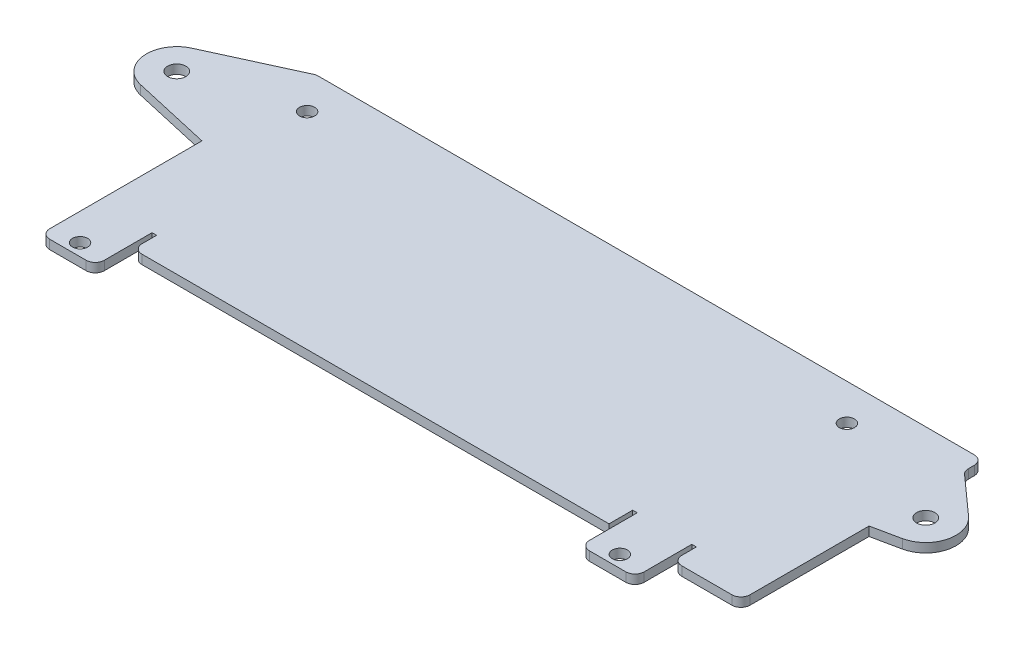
ISO-10303-21;
HEADER;
FILE_DESCRIPTION(('STEP AP214'),'2;1');
FILE_NAME('part.step','',(''),(''),'','','');
FILE_SCHEMA(('AUTOMOTIVE_DESIGN { 1 0 10303 214 1 1 1 1 }'));
ENDSEC;
DATA;
#1=APPLICATION_CONTEXT('core data for automotive mechanical design processes');
#2=APPLICATION_PROTOCOL_DEFINITION('international standard','automotive_design',2000,#1);
#3=PRODUCT_CONTEXT('',#1,'mechanical');
#4=PRODUCT('Part','Part','',(#3));
#5=PRODUCT_RELATED_PRODUCT_CATEGORY('part','',(#4));
#6=PRODUCT_DEFINITION_FORMATION('','',#4);
#7=PRODUCT_DEFINITION_CONTEXT('part definition',#1,'design');
#8=PRODUCT_DEFINITION('design','',#6,#7);
#9=PRODUCT_DEFINITION_SHAPE('','',#8);
#10=(LENGTH_UNIT() NAMED_UNIT(*) SI_UNIT(.MILLI.,.METRE.));
#11=(NAMED_UNIT(*) PLANE_ANGLE_UNIT() SI_UNIT($,.RADIAN.));
#12=(NAMED_UNIT(*) SI_UNIT($,.STERADIAN.) SOLID_ANGLE_UNIT());
#13=UNCERTAINTY_MEASURE_WITH_UNIT(LENGTH_MEASURE(1.E-05),#10,'distance_accuracy_value','');
#14=(GEOMETRIC_REPRESENTATION_CONTEXT(3) GLOBAL_UNCERTAINTY_ASSIGNED_CONTEXT((#13)) GLOBAL_UNIT_ASSIGNED_CONTEXT((#10,
#11,#12)) REPRESENTATION_CONTEXT('',''));
#15=CARTESIAN_POINT('',(0.,0.,0.));
#16=DIRECTION('',(0.,0.,1.));
#17=DIRECTION('',(1.,0.,0.));
#18=AXIS2_PLACEMENT_3D('',#15,#16,#17);
#19=CARTESIAN_POINT('',(0.,0.,0.));
#20=DIRECTION('',(0.,1.,0.));
#21=DIRECTION('',(0.,0.,1.));
#22=AXIS2_PLACEMENT_3D('',#19,#20,#21);
#23=PLANE('',#22);
#24=DIRECTION('',(0.,0.,-1.));
#25=VECTOR('',#24,1.);
#26=CARTESIAN_POINT('',(43.75,0.,8.46991118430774));
#27=LINE('',#26,#25);
#28=CARTESIAN_POINT('',(43.75,1.12757025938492E-13,27.4699111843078));
#29=VERTEX_POINT('',#28);
#30=CARTESIAN_POINT('',(43.75,0.,25.0699111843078));
#31=VERTEX_POINT('',#30);
#32=EDGE_CURVE('E610',#29,#31,#27,.T.);
#33=ORIENTED_EDGE('',*,*,#32,.F.);
#34=CARTESIAN_POINT('',(45.25,1.12757025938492E-13,27.4699111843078));
#35=DIRECTION('',(0.,-1.,0.));
#36=DIRECTION('',(0.,0.,-1.));
#37=AXIS2_PLACEMENT_3D('',#34,#35,#36);
#38=CIRCLE('',#37,1.5);
#39=CARTESIAN_POINT('',(45.25,1.23165366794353E-13,28.9699111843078));
#40=VERTEX_POINT('',#39);
#41=EDGE_CURVE('E700',#29,#40,#38,.F.);
#42=ORIENTED_EDGE('',*,*,#41,.T.);
#43=DIRECTION('',(1.,0.,0.));
#44=VECTOR('',#43,1.);
#45=CARTESIAN_POINT('',(0.,1.30104260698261E-13,28.9699111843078));
#46=LINE('',#45,#44);
#47=CARTESIAN_POINT('',(53.5,1.23165366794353E-13,28.9699111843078));
#48=VERTEX_POINT('',#47);
#49=EDGE_CURVE('E675',#40,#48,#46,.T.);
#50=ORIENTED_EDGE('',*,*,#49,.T.);
#51=CARTESIAN_POINT('',(53.5,1.12757025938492E-13,27.4699111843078));
#52=DIRECTION('',(0.,-1.,0.));
#53=DIRECTION('',(0.,0.,-1.));
#54=AXIS2_PLACEMENT_3D('',#51,#52,#53);
#55=CIRCLE('',#54,1.5);
#56=CARTESIAN_POINT('',(55.,1.11022302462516E-13,27.4699111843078));
#57=VERTEX_POINT('',#56);
#58=EDGE_CURVE('E697',#48,#57,#55,.F.);
#59=ORIENTED_EDGE('',*,*,#58,.T.);
#60=DIRECTION('',(0.,0.,-1.));
#61=VECTOR('',#60,1.);
#62=CARTESIAN_POINT('',(55.,0.,8.46991118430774));
#63=LINE('',#62,#61);
#64=CARTESIAN_POINT('',(55.,0.,7.85000000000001));
#65=VERTEX_POINT('',#64);
#66=EDGE_CURVE('E353',#57,#65,#63,.T.);
#67=ORIENTED_EDGE('',*,*,#66,.T.);
#68=DIRECTION('',(0.978394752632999,0.,-0.206745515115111));
#69=VECTOR('',#68,1.);
#70=CARTESIAN_POINT('',(55.,0.,7.85000000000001));
#71=LINE('',#70,#69);
#72=CARTESIAN_POINT('',(59.5337275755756,0.,6.89197376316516));
#73=VERTEX_POINT('',#72);
#74=EDGE_CURVE('E330',#65,#73,#71,.T.);
#75=ORIENTED_EDGE('',*,*,#74,.T.);
#76=CARTESIAN_POINT('',(58.5,0.,2.00000000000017));
#77=DIRECTION('',(0.,1.,0.));
#78=DIRECTION('',(0.,0.,-1.));
#79=AXIS2_PLACEMENT_3D('',#76,#77,#78);
#80=CIRCLE('',#79,5.);
#81=CARTESIAN_POINT('',(61.8367523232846,0.,-1.72371909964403));
#82=VERTEX_POINT('',#81);
#83=EDGE_CURVE('E341',#73,#82,#80,.T.);
#84=ORIENTED_EDGE('',*,*,#83,.T.);
#85=DIRECTION('',(-0.74474381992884,0.,-0.667350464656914));
#86=VECTOR('',#85,1.);
#87=CARTESIAN_POINT('',(55.,0.,-7.85000000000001));
#88=LINE('',#87,#86);
#89=CARTESIAN_POINT('',(55.4989743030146,0.,-7.40287882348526));
#90=VERTEX_POINT('',#89);
#91=EDGE_CURVE('E348',#82,#90,#88,.T.);
#92=ORIENTED_EDGE('',*,*,#91,.T.);
#93=CARTESIAN_POINT('',(56.5,0.,-8.51999455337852));
#94=DIRECTION('',(0.,1.,0.));
#95=DIRECTION('',(0.,0.,1.));
#96=AXIS2_PLACEMENT_3D('',#93,#94,#95);
#97=CIRCLE('',#96,1.5);
#98=CARTESIAN_POINT('',(55.,0.,-8.51999455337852));
#99=VERTEX_POINT('',#98);
#100=EDGE_CURVE('E791',#90,#99,#97,.F.);
#101=ORIENTED_EDGE('',*,*,#100,.T.);
#102=DIRECTION('',(0.,0.,-1.));
#103=VECTOR('',#102,1.);
#104=CARTESIAN_POINT('',(55.,0.,11.));
#105=LINE('',#104,#103);
#106=CARTESIAN_POINT('',(55.,0.,-9.50000000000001));
#107=VERTEX_POINT('',#106);
#108=EDGE_CURVE('E379',#99,#107,#105,.T.);
#109=ORIENTED_EDGE('',*,*,#108,.T.);
#110=CARTESIAN_POINT('',(53.5,0.,-9.50000000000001));
#111=DIRECTION('',(0.,1.,0.));
#112=DIRECTION('',(0.,0.,1.));
#113=AXIS2_PLACEMENT_3D('',#110,#111,#112);
#114=CIRCLE('',#113,1.5);
#115=CARTESIAN_POINT('',(53.5,0.,-11.));
#116=VERTEX_POINT('',#115);
#117=EDGE_CURVE('E376',#107,#116,#114,.T.);
#118=ORIENTED_EDGE('',*,*,#117,.T.);
#119=DIRECTION('',(-1.,0.,0.));
#120=VECTOR('',#119,1.);
#121=CARTESIAN_POINT('',(55.,0.,-11.));
#122=LINE('',#121,#120);
#123=CARTESIAN_POINT('',(-54.6726312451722,0.,-11.));
#124=VERTEX_POINT('',#123);
#125=EDGE_CURVE('E372',#116,#124,#122,.T.);
#126=ORIENTED_EDGE('',*,*,#125,.T.);
#127=CARTESIAN_POINT('',(-54.6726312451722,0.,-9.49999999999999));
#128=DIRECTION('',(0.,1.,0.));
#129=DIRECTION('',(0.,0.,1.));
#130=AXIS2_PLACEMENT_3D('',#127,#128,#129);
#131=CIRCLE('',#130,1.5);
#132=CARTESIAN_POINT('',(-55.2976006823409,0.,-10.8636030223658));
#133=VERTEX_POINT('',#132);
#134=EDGE_CURVE('E369',#124,#133,#131,.T.);
#135=ORIENTED_EDGE('',*,*,#134,.T.);
#136=DIRECTION('',(-0.909068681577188,0.,0.41664629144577));
#137=VECTOR('',#136,1.);
#138=CARTESIAN_POINT('',(-69.0832314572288,0.,-4.54534340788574));
#139=LINE('',#138,#137);
#140=CARTESIAN_POINT('',(-69.0832314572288,0.,-4.54534340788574));
#141=VERTEX_POINT('',#140);
#142=EDGE_CURVE('E366',#133,#141,#139,.T.);
#143=ORIENTED_EDGE('',*,*,#142,.T.);
#144=CARTESIAN_POINT('',(-67.,0.,1.93626364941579E-13));
#145=DIRECTION('',(0.,1.,0.));
#146=DIRECTION('',(0.,0.,1.));
#147=AXIS2_PLACEMENT_3D('',#144,#145,#146);
#148=CIRCLE('',#147,5.);
#149=CARTESIAN_POINT('',(-68.1064148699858,0.,4.87604820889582));
#150=VERTEX_POINT('',#149);
#151=EDGE_CURVE('E359',#141,#150,#148,.T.);
#152=ORIENTED_EDGE('',*,*,#151,.T.);
#153=DIRECTION('',(0.975209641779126,0.,0.221282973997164));
#154=VECTOR('',#153,1.);
#155=CARTESIAN_POINT('',(-55.,0.,7.85000000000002));
#156=LINE('',#155,#154);
#157=CARTESIAN_POINT('',(-55.,0.,7.85000000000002));
#158=VERTEX_POINT('',#157);
#159=EDGE_CURVE('E355',#150,#158,#156,.T.);
#160=ORIENTED_EDGE('',*,*,#159,.T.);
#161=DIRECTION('',(0.,0.,1.));
#162=VECTOR('',#161,1.);
#163=CARTESIAN_POINT('',(-55.,0.,8.46991118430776));
#164=LINE('',#163,#162);
#165=CARTESIAN_POINT('',(-55.,1.90819582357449E-13,32.9398223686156));
#166=VERTEX_POINT('',#165);
#167=EDGE_CURVE('E679',#158,#166,#164,.T.);
#168=ORIENTED_EDGE('',*,*,#167,.T.);
#169=CARTESIAN_POINT('',(-53.5,1.90819582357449E-13,32.9398223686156));
#170=DIRECTION('',(0.,-1.,0.));
#171=DIRECTION('',(0.,0.,-1.));
#172=AXIS2_PLACEMENT_3D('',#169,#170,#171);
#173=CIRCLE('',#172,1.5);
#174=CARTESIAN_POINT('',(-53.5,2.13370987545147E-13,34.4398223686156));
#175=VERTEX_POINT('',#174);
#176=EDGE_CURVE('E537',#166,#175,#173,.F.);
#177=ORIENTED_EDGE('',*,*,#176,.T.);
#178=DIRECTION('',(1.,0.,0.));
#179=VECTOR('',#178,1.);
#180=CARTESIAN_POINT('',(-89.,2.13370987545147E-13,34.4398223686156));
#181=LINE('',#180,#179);
#182=CARTESIAN_POINT('',(-47.5,2.13370987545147E-13,34.4398223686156));
#183=VERTEX_POINT('',#182);
#184=EDGE_CURVE('E544',#175,#183,#181,.T.);
#185=ORIENTED_EDGE('',*,*,#184,.T.);
#186=CARTESIAN_POINT('',(-47.5,1.90819582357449E-13,32.9398223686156));
#187=DIRECTION('',(0.,-1.,0.));
#188=DIRECTION('',(0.,0.,-1.));
#189=AXIS2_PLACEMENT_3D('',#186,#187,#188);
#190=CIRCLE('',#189,1.5);
#191=CARTESIAN_POINT('',(-46.,1.90819582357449E-13,32.9398223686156));
#192=VERTEX_POINT('',#191);
#193=EDGE_CURVE('E540',#183,#192,#190,.F.);
#194=ORIENTED_EDGE('',*,*,#193,.T.);
#195=DIRECTION('',(0.,0.,1.));
#196=VECTOR('',#195,1.);
#197=CARTESIAN_POINT('',(-46.,0.,8.46991118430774));
#198=LINE('',#197,#196);
#199=CARTESIAN_POINT('',(-46.,1.09287578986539E-13,25.0699111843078));
#200=VERTEX_POINT('',#199);
#201=EDGE_CURVE('E602',#200,#192,#198,.T.);
#202=ORIENTED_EDGE('',*,*,#201,.F.);
#203=DIRECTION('',(-1.,0.,0.));
#204=VECTOR('',#203,1.);
#205=CARTESIAN_POINT('',(0.,1.02348685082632E-13,25.0699111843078));
#206=LINE('',#205,#204);
#207=CARTESIAN_POINT('',(-45.25,1.09287578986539E-13,25.0699111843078));
#208=VERTEX_POINT('',#207);
#209=EDGE_CURVE('E598',#208,#200,#206,.T.);
#210=ORIENTED_EDGE('',*,*,#209,.F.);
#211=DIRECTION('',(0.,0.,-1.));
#212=VECTOR('',#211,1.);
#213=CARTESIAN_POINT('',(-45.25,0.,8.46991118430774));
#214=LINE('',#213,#212);
#215=CARTESIAN_POINT('',(-45.25,1.26634813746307E-13,27.4699111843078));
#216=VERTEX_POINT('',#215);
#217=EDGE_CURVE('E581',#216,#208,#214,.T.);
#218=ORIENTED_EDGE('',*,*,#217,.F.);
#219=CARTESIAN_POINT('',(-43.75,1.26634813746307E-13,27.4699111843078));
#220=DIRECTION('',(0.,-1.,0.));
#221=DIRECTION('',(0.,0.,-1.));
#222=AXIS2_PLACEMENT_3D('',#219,#220,#221);
#223=CIRCLE('',#222,1.5);
#224=CARTESIAN_POINT('',(-43.75,1.37043154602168E-13,28.9699111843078));
#225=VERTEX_POINT('',#224);
#226=EDGE_CURVE('E694',#216,#225,#223,.F.);
#227=ORIENTED_EDGE('',*,*,#226,.T.);
#228=CARTESIAN_POINT('',(33.25,1.2490009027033E-13,28.9699111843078));
#229=VERTEX_POINT('',#228);
#230=EDGE_CURVE('E674',#225,#229,#46,.T.);
#231=ORIENTED_EDGE('',*,*,#230,.T.);
#232=DIRECTION('',(0.,0.,1.));
#233=VECTOR('',#232,1.);
#234=CARTESIAN_POINT('',(33.25,0.,8.46991118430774));
#235=LINE('',#234,#233);
#236=CARTESIAN_POINT('',(33.25,0.,25.0699111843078));
#237=VERTEX_POINT('',#236);
#238=EDGE_CURVE('E651',#237,#229,#235,.T.);
#239=ORIENTED_EDGE('',*,*,#238,.F.);
#240=DIRECTION('',(-1.,0.,0.));
#241=VECTOR('',#240,1.);
#242=CARTESIAN_POINT('',(0.,1.02348685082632E-13,25.0699111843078));
#243=LINE('',#242,#241);
#244=CARTESIAN_POINT('',(34.,0.,25.0699111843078));
#245=VERTEX_POINT('',#244);
#246=EDGE_CURVE('E666',#245,#237,#243,.T.);
#247=ORIENTED_EDGE('',*,*,#246,.F.);
#248=DIRECTION('',(0.,0.,-1.));
#249=VECTOR('',#248,1.);
#250=CARTESIAN_POINT('',(34.,0.,8.46991118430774));
#251=LINE('',#250,#249);
#252=CARTESIAN_POINT('',(34.,1.76941794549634E-13,32.9398223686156));
#253=VERTEX_POINT('',#252);
#254=EDGE_CURVE('E662',#253,#245,#251,.T.);
#255=ORIENTED_EDGE('',*,*,#254,.F.);
#256=CARTESIAN_POINT('',(35.5,1.76941794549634E-13,32.9398223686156));
#257=DIRECTION('',(0.,-1.,0.));
#258=DIRECTION('',(0.,0.,-1.));
#259=AXIS2_PLACEMENT_3D('',#256,#257,#258);
#260=CIRCLE('',#259,1.5);
#261=CARTESIAN_POINT('',(35.5,1.99493199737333E-13,34.4398223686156));
#262=VERTEX_POINT('',#261);
#263=EDGE_CURVE('E500',#253,#262,#260,.F.);
#264=ORIENTED_EDGE('',*,*,#263,.T.);
#265=DIRECTION('',(1.,0.,0.));
#266=VECTOR('',#265,1.);
#267=CARTESIAN_POINT('',(0.,1.99493199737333E-13,34.4398223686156));
#268=LINE('',#267,#266);
#269=CARTESIAN_POINT('',(41.5,1.99493199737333E-13,34.4398223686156));
#270=VERTEX_POINT('',#269);
#271=EDGE_CURVE('E496',#262,#270,#268,.T.);
#272=ORIENTED_EDGE('',*,*,#271,.T.);
#273=CARTESIAN_POINT('',(41.5,1.76941794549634E-13,32.9398223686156));
#274=DIRECTION('',(0.,-1.,0.));
#275=DIRECTION('',(0.,0.,-1.));
#276=AXIS2_PLACEMENT_3D('',#273,#274,#275);
#277=CIRCLE('',#276,1.5);
#278=CARTESIAN_POINT('',(43.,1.76941794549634E-13,32.9398223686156));
#279=VERTEX_POINT('',#278);
#280=EDGE_CURVE('E492',#270,#279,#277,.F.);
#281=ORIENTED_EDGE('',*,*,#280,.T.);
#282=DIRECTION('',(0.,0.,1.));
#283=VECTOR('',#282,1.);
#284=CARTESIAN_POINT('',(43.,0.,8.46991118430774));
#285=LINE('',#284,#283);
#286=CARTESIAN_POINT('',(43.,0.,25.0699111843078));
#287=VERTEX_POINT('',#286);
#288=EDGE_CURVE('E659',#287,#279,#285,.T.);
#289=ORIENTED_EDGE('',*,*,#288,.F.);
#290=DIRECTION('',(-1.,0.,0.));
#291=VECTOR('',#290,1.);
#292=CARTESIAN_POINT('',(0.,1.02348685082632E-13,25.0699111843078));
#293=LINE('',#292,#291);
#294=EDGE_CURVE('E655',#31,#287,#293,.T.);
#295=ORIENTED_EDGE('',*,*,#294,.F.);
#296=EDGE_LOOP('',(#33,#42,#50,#59,#67,#75,#84,#92,#101,#109,#118,#126,#135,#143,#152,#160,#168,
#177,#185,#194,#202,#210,#218,#227,#231,#239,#247,#255,#264,#272,#281,#289,#295));
#297=FACE_BOUND('',#296,.T.);
#298=CARTESIAN_POINT('',(-50.5,1.85615411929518E-13,32.4398223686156));
#299=DIRECTION('',(0.,1.,0.));
#300=DIRECTION('',(0.,0.,1.));
#301=AXIS2_PLACEMENT_3D('',#298,#299,#300);
#302=CIRCLE('',#301,1.25);
#303=CARTESIAN_POINT('',(-50.5,2.0301773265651E-13,33.6898223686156));
#304=VERTEX_POINT('',#303);
#305=EDGE_CURVE('E563',#304,#304,#302,.T.);
#306=ORIENTED_EDGE('',*,*,#305,.F.);
#307=EDGE_LOOP('',(#306));
#308=FACE_BOUND('',#307,.T.);
#309=CARTESIAN_POINT('',(38.5,1.71737624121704E-13,32.4398223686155));
#310=DIRECTION('',(0.,1.,0.));
#311=DIRECTION('',(0.,0.,1.));
#312=AXIS2_PLACEMENT_3D('',#309,#310,#311);
#313=CIRCLE('',#312,1.25);
#314=CARTESIAN_POINT('',(38.5,1.89139944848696E-13,33.6898223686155));
#315=VERTEX_POINT('',#314);
#316=EDGE_CURVE('E518',#315,#315,#313,.T.);
#317=ORIENTED_EDGE('',*,*,#316,.F.);
#318=EDGE_LOOP('',(#317));
#319=FACE_BOUND('',#318,.T.);
#320=CARTESIAN_POINT('',(-50.5,0.,-5.00000000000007));
#321=DIRECTION('',(0.,1.,0.));
#322=DIRECTION('',(0.,0.,-1.));
#323=AXIS2_PLACEMENT_3D('',#320,#321,#322);
#324=CIRCLE('',#323,1.25);
#325=CARTESIAN_POINT('',(-50.5,0.,-6.25000000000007));
#326=VERTEX_POINT('',#325);
#327=EDGE_CURVE('E408',#326,#326,#324,.T.);
#328=ORIENTED_EDGE('',*,*,#327,.F.);
#329=EDGE_LOOP('',(#328));
#330=FACE_BOUND('',#329,.T.);
#331=CARTESIAN_POINT('',(38.5,0.,-5.00000000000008));
#332=DIRECTION('',(0.,1.,0.));
#333=DIRECTION('',(0.,0.,-1.));
#334=AXIS2_PLACEMENT_3D('',#331,#332,#333);
#335=CIRCLE('',#334,1.25);
#336=CARTESIAN_POINT('',(38.5,0.,-6.25000000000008));
#337=VERTEX_POINT('',#336);
#338=EDGE_CURVE('E416',#337,#337,#335,.T.);
#339=ORIENTED_EDGE('',*,*,#338,.F.);
#340=EDGE_LOOP('',(#339));
#341=FACE_BOUND('',#340,.T.);
#342=CARTESIAN_POINT('',(-67.,0.,1.93626364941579E-13));
#343=DIRECTION('',(0.,1.,0.));
#344=DIRECTION('',(0.,0.,1.));
#345=AXIS2_PLACEMENT_3D('',#342,#343,#344);
#346=CIRCLE('',#345,1.5);
#347=CARTESIAN_POINT('',(-67.,0.,1.50000000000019));
#348=VERTEX_POINT('',#347);
#349=EDGE_CURVE('E476',#348,#348,#346,.T.);
#350=ORIENTED_EDGE('',*,*,#349,.F.);
#351=EDGE_LOOP('',(#350));
#352=FACE_BOUND('',#351,.T.);
#353=CARTESIAN_POINT('',(58.5,0.,2.00000000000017));
#354=DIRECTION('',(0.,1.,0.));
#355=DIRECTION('',(0.,0.,1.));
#356=AXIS2_PLACEMENT_3D('',#353,#354,#355);
#357=CIRCLE('',#356,1.50000000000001);
#358=CARTESIAN_POINT('',(58.5,0.,3.50000000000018));
#359=VERTEX_POINT('',#358);
#360=EDGE_CURVE('E480',#359,#359,#357,.T.);
#361=ORIENTED_EDGE('',*,*,#360,.F.);
#362=EDGE_LOOP('',(#361));
#363=FACE_BOUND('',#362,.T.);
#364=ADVANCED_FACE('F111',(#297,#308,#319,#330,#341,#352,#363),#23,.T.);
#365=CARTESIAN_POINT('',(0.,-1.50000000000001,8.46991118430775));
#366=DIRECTION('',(0.,-1.,0.));
#367=DIRECTION('',(0.,0.,-1.));
#368=AXIS2_PLACEMENT_3D('',#365,#366,#367);
#369=PLANE('',#368);
#370=DIRECTION('',(-1.,0.,0.));
#371=VECTOR('',#370,1.);
#372=CARTESIAN_POINT('',(55.,-1.49999999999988,28.9699111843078));
#373=LINE('',#372,#371);
#374=CARTESIAN_POINT('',(45.25,-1.49999999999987,28.9699111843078));
#375=VERTEX_POINT('',#374);
#376=CARTESIAN_POINT('',(53.5,-1.49999999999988,28.9699111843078));
#377=VERTEX_POINT('',#376);
#378=EDGE_CURVE('E688',#375,#377,#373,.F.);
#379=ORIENTED_EDGE('',*,*,#378,.F.);
#380=CARTESIAN_POINT('',(45.25,-1.49999999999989,27.4699111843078));
#381=DIRECTION('',(0.,-1.,0.));
#382=DIRECTION('',(0.,0.,-1.));
#383=AXIS2_PLACEMENT_3D('',#380,#381,#382);
#384=CIRCLE('',#383,1.5);
#385=CARTESIAN_POINT('',(43.75,-1.49999999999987,27.4699111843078));
#386=VERTEX_POINT('',#385);
#387=EDGE_CURVE('E714',#375,#386,#384,.T.);
#388=ORIENTED_EDGE('',*,*,#387,.T.);
#389=DIRECTION('',(0.,0.,1.));
#390=VECTOR('',#389,1.);
#391=CARTESIAN_POINT('',(43.75,-1.49999999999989,25.0699111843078));
#392=LINE('',#391,#390);
#393=CARTESIAN_POINT('',(43.75,-1.4999999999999,25.0699111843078));
#394=VERTEX_POINT('',#393);
#395=EDGE_CURVE('E630',#394,#386,#392,.T.);
#396=ORIENTED_EDGE('',*,*,#395,.F.);
#397=DIRECTION('',(1.,0.,0.));
#398=VECTOR('',#397,1.);
#399=CARTESIAN_POINT('',(43.,-1.49999999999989,25.0699111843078));
#400=LINE('',#399,#398);
#401=CARTESIAN_POINT('',(43.,-1.4999999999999,25.0699111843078));
#402=VERTEX_POINT('',#401);
#403=EDGE_CURVE('E625',#402,#394,#400,.T.);
#404=ORIENTED_EDGE('',*,*,#403,.F.);
#405=DIRECTION('',(0.,0.,-1.));
#406=VECTOR('',#405,1.);
#407=CARTESIAN_POINT('',(43.,-1.49999999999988,25.8199111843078));
#408=LINE('',#407,#406);
#409=CARTESIAN_POINT('',(43.,-1.49999999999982,32.9398223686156));
#410=VERTEX_POINT('',#409);
#411=EDGE_CURVE('E621',#410,#402,#408,.T.);
#412=ORIENTED_EDGE('',*,*,#411,.F.);
#413=CARTESIAN_POINT('',(41.5,-1.49999999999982,32.9398223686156));
#414=DIRECTION('',(0.,-1.,0.));
#415=DIRECTION('',(0.,0.,-1.));
#416=AXIS2_PLACEMENT_3D('',#413,#414,#415);
#417=CIRCLE('',#416,1.5);
#418=CARTESIAN_POINT('',(41.5,-1.4999999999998,34.4398223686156));
#419=VERTEX_POINT('',#418);
#420=EDGE_CURVE('E507',#410,#419,#417,.T.);
#421=ORIENTED_EDGE('',*,*,#420,.T.);
#422=DIRECTION('',(-1.,0.,0.));
#423=VECTOR('',#422,1.);
#424=CARTESIAN_POINT('',(43.,-1.4999999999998,34.4398223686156));
#425=LINE('',#424,#423);
#426=CARTESIAN_POINT('',(35.5,-1.4999999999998,34.4398223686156));
#427=VERTEX_POINT('',#426);
#428=EDGE_CURVE('E525',#427,#419,#425,.F.);
#429=ORIENTED_EDGE('',*,*,#428,.F.);
#430=CARTESIAN_POINT('',(35.5,-1.49999999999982,32.9398223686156));
#431=DIRECTION('',(0.,-1.,0.));
#432=DIRECTION('',(0.,0.,-1.));
#433=AXIS2_PLACEMENT_3D('',#430,#431,#432);
#434=CIRCLE('',#433,1.5);
#435=CARTESIAN_POINT('',(34.,-1.49999999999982,32.9398223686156));
#436=VERTEX_POINT('',#435);
#437=EDGE_CURVE('E510',#427,#436,#434,.T.);
#438=ORIENTED_EDGE('',*,*,#437,.T.);
#439=DIRECTION('',(0.,0.,1.));
#440=VECTOR('',#439,1.);
#441=CARTESIAN_POINT('',(34.,-1.49999999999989,25.0699111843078));
#442=LINE('',#441,#440);
#443=CARTESIAN_POINT('',(34.,-1.4999999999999,25.0699111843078));
#444=VERTEX_POINT('',#443);
#445=EDGE_CURVE('E617',#444,#436,#442,.T.);
#446=ORIENTED_EDGE('',*,*,#445,.F.);
#447=DIRECTION('',(1.,0.,0.));
#448=VECTOR('',#447,1.);
#449=CARTESIAN_POINT('',(33.25,-1.49999999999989,25.0699111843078));
#450=LINE('',#449,#448);
#451=CARTESIAN_POINT('',(33.25,-1.4999999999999,25.0699111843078));
#452=VERTEX_POINT('',#451);
#453=EDGE_CURVE('E612',#452,#444,#450,.T.);
#454=ORIENTED_EDGE('',*,*,#453,.F.);
#455=DIRECTION('',(0.,0.,-1.));
#456=VECTOR('',#455,1.);
#457=CARTESIAN_POINT('',(33.25,-1.49999999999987,28.9699111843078));
#458=LINE('',#457,#456);
#459=CARTESIAN_POINT('',(33.25,-1.49999999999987,28.9699111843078));
#460=VERTEX_POINT('',#459);
#461=EDGE_CURVE('E606',#460,#452,#458,.T.);
#462=ORIENTED_EDGE('',*,*,#461,.F.);
#463=CARTESIAN_POINT('',(-43.75,-1.49999999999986,28.9699111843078));
#464=VERTEX_POINT('',#463);
#465=EDGE_CURVE('E685',#464,#460,#373,.F.);
#466=ORIENTED_EDGE('',*,*,#465,.F.);
#467=CARTESIAN_POINT('',(-43.75,-1.49999999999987,27.4699111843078));
#468=DIRECTION('',(0.,-1.,0.));
#469=DIRECTION('',(0.,0.,-1.));
#470=AXIS2_PLACEMENT_3D('',#467,#468,#469);
#471=CIRCLE('',#470,1.5);
#472=CARTESIAN_POINT('',(-45.25,-1.49999999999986,27.4699111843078));
#473=VERTEX_POINT('',#472);
#474=EDGE_CURVE('E126',#464,#473,#471,.T.);
#475=ORIENTED_EDGE('',*,*,#474,.T.);
#476=DIRECTION('',(0.,0.,1.));
#477=VECTOR('',#476,1.);
#478=CARTESIAN_POINT('',(-45.25,-1.49999999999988,25.0699111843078));
#479=LINE('',#478,#477);
#480=CARTESIAN_POINT('',(-45.25,-1.49999999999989,25.0699111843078));
#481=VERTEX_POINT('',#480);
#482=EDGE_CURVE('E587',#481,#473,#479,.T.);
#483=ORIENTED_EDGE('',*,*,#482,.F.);
#484=DIRECTION('',(1.,0.,0.));
#485=VECTOR('',#484,1.);
#486=CARTESIAN_POINT('',(-46.,-1.49999999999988,25.0699111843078));
#487=LINE('',#486,#485);
#488=CARTESIAN_POINT('',(-46.,-1.49999999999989,25.0699111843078));
#489=VERTEX_POINT('',#488);
#490=EDGE_CURVE('E582',#489,#481,#487,.T.);
#491=ORIENTED_EDGE('',*,*,#490,.F.);
#492=DIRECTION('',(0.,0.,-1.));
#493=VECTOR('',#492,1.);
#494=CARTESIAN_POINT('',(-46.,-1.49999999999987,25.8199111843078));
#495=LINE('',#494,#493);
#496=CARTESIAN_POINT('',(-46.,-1.49999999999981,32.9398223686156));
#497=VERTEX_POINT('',#496);
#498=EDGE_CURVE('E577',#497,#489,#495,.T.);
#499=ORIENTED_EDGE('',*,*,#498,.F.);
#500=CARTESIAN_POINT('',(-47.5,-1.49999999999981,32.9398223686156));
#501=DIRECTION('',(0.,-1.,0.));
#502=DIRECTION('',(0.,0.,-1.));
#503=AXIS2_PLACEMENT_3D('',#500,#501,#502);
#504=CIRCLE('',#503,1.5);
#505=CARTESIAN_POINT('',(-47.5,-1.49999999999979,34.4398223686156));
#506=VERTEX_POINT('',#505);
#507=EDGE_CURVE('E556',#497,#506,#504,.T.);
#508=ORIENTED_EDGE('',*,*,#507,.T.);
#509=DIRECTION('',(-1.,0.,0.));
#510=VECTOR('',#509,1.);
#511=CARTESIAN_POINT('',(-46.,-1.49999999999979,34.4398223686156));
#512=LINE('',#511,#510);
#513=CARTESIAN_POINT('',(-53.5,-1.49999999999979,34.4398223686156));
#514=VERTEX_POINT('',#513);
#515=EDGE_CURVE('E491',#514,#506,#512,.F.);
#516=ORIENTED_EDGE('',*,*,#515,.F.);
#517=CARTESIAN_POINT('',(-53.5,-1.49999999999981,32.9398223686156));
#518=DIRECTION('',(0.,-1.,0.));
#519=DIRECTION('',(0.,0.,-1.));
#520=AXIS2_PLACEMENT_3D('',#517,#518,#519);
#521=CIRCLE('',#520,1.5);
#522=CARTESIAN_POINT('',(-55.,-1.49999999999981,32.9398223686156));
#523=VERTEX_POINT('',#522);
#524=EDGE_CURVE('E552',#514,#523,#521,.T.);
#525=ORIENTED_EDGE('',*,*,#524,.T.);
#526=DIRECTION('',(0.,0.,-1.));
#527=VECTOR('',#526,1.);
#528=CARTESIAN_POINT('',(-55.,-1.49999999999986,28.9699111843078));
#529=LINE('',#528,#527);
#530=CARTESIAN_POINT('',(-55.,-1.5,7.85000000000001));
#531=VERTEX_POINT('',#530);
#532=EDGE_CURVE('E670',#531,#523,#529,.F.);
#533=ORIENTED_EDGE('',*,*,#532,.F.);
#534=DIRECTION('',(0.975209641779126,0.,0.221282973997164));
#535=VECTOR('',#534,1.);
#536=CARTESIAN_POINT('',(-55.,-1.5,7.85000000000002));
#537=LINE('',#536,#535);
#538=CARTESIAN_POINT('',(-68.1064148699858,-1.5,4.87604820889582));
#539=VERTEX_POINT('',#538);
#540=EDGE_CURVE('E387',#539,#531,#537,.T.);
#541=ORIENTED_EDGE('',*,*,#540,.F.);
#542=CARTESIAN_POINT('',(-67.,-1.5,1.93626364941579E-13));
#543=DIRECTION('',(0.,1.,0.));
#544=DIRECTION('',(0.,0.,1.));
#545=AXIS2_PLACEMENT_3D('',#542,#543,#544);
#546=CIRCLE('',#545,5.);
#547=CARTESIAN_POINT('',(-69.0832314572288,-1.5,-4.54534340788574));
#548=VERTEX_POINT('',#547);
#549=EDGE_CURVE('E462',#548,#539,#546,.T.);
#550=ORIENTED_EDGE('',*,*,#549,.F.);
#551=DIRECTION('',(-0.909068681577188,0.,0.41664629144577));
#552=VECTOR('',#551,1.);
#553=CARTESIAN_POINT('',(-69.0832314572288,-1.5,-4.54534340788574));
#554=LINE('',#553,#552);
#555=CARTESIAN_POINT('',(-55.2976006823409,-1.5,-10.8636030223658));
#556=VERTEX_POINT('',#555);
#557=EDGE_CURVE('E470',#556,#548,#554,.T.);
#558=ORIENTED_EDGE('',*,*,#557,.F.);
#559=CARTESIAN_POINT('',(-54.6726312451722,-1.5,-9.49999999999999));
#560=DIRECTION('',(0.,1.,0.));
#561=DIRECTION('',(0.,0.,1.));
#562=AXIS2_PLACEMENT_3D('',#559,#560,#561);
#563=CIRCLE('',#562,1.5);
#564=CARTESIAN_POINT('',(-54.6726312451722,-1.5,-11.));
#565=VERTEX_POINT('',#564);
#566=EDGE_CURVE('E399',#556,#565,#563,.F.);
#567=ORIENTED_EDGE('',*,*,#566,.T.);
#568=DIRECTION('',(-1.,0.,0.));
#569=VECTOR('',#568,1.);
#570=CARTESIAN_POINT('',(55.,-1.5,-11.));
#571=LINE('',#570,#569);
#572=CARTESIAN_POINT('',(53.5,-1.5,-11.));
#573=VERTEX_POINT('',#572);
#574=EDGE_CURVE('E428',#573,#565,#571,.T.);
#575=ORIENTED_EDGE('',*,*,#574,.F.);
#576=CARTESIAN_POINT('',(53.5,-1.5,-9.50000000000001));
#577=DIRECTION('',(0.,1.,0.));
#578=DIRECTION('',(0.,0.,1.));
#579=AXIS2_PLACEMENT_3D('',#576,#577,#578);
#580=CIRCLE('',#579,1.5);
#581=CARTESIAN_POINT('',(55.,-1.5,-9.50000000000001));
#582=VERTEX_POINT('',#581);
#583=EDGE_CURVE('E405',#573,#582,#580,.F.);
#584=ORIENTED_EDGE('',*,*,#583,.T.);
#585=DIRECTION('',(0.,0.,-1.));
#586=VECTOR('',#585,1.);
#587=CARTESIAN_POINT('',(55.,-1.5,11.));
#588=LINE('',#587,#586);
#589=CARTESIAN_POINT('',(55.,-1.5,-8.51999455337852));
#590=VERTEX_POINT('',#589);
#591=EDGE_CURVE('E439',#590,#582,#588,.T.);
#592=ORIENTED_EDGE('',*,*,#591,.F.);
#593=CARTESIAN_POINT('',(56.5,-1.5,-8.51999455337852));
#594=DIRECTION('',(0.,1.,0.));
#595=DIRECTION('',(0.,0.,1.));
#596=AXIS2_PLACEMENT_3D('',#593,#594,#595);
#597=CIRCLE('',#596,1.5);
#598=CARTESIAN_POINT('',(55.4989743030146,-1.5,-7.40287882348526));
#599=VERTEX_POINT('',#598);
#600=EDGE_CURVE('E402',#590,#599,#597,.T.);
#601=ORIENTED_EDGE('',*,*,#600,.T.);
#602=DIRECTION('',(-0.74474381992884,0.,-0.667350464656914));
#603=VECTOR('',#602,1.);
#604=CARTESIAN_POINT('',(55.,-1.5,-7.85000000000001));
#605=LINE('',#604,#603);
#606=CARTESIAN_POINT('',(61.8367523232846,-1.5,-1.72371909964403));
#607=VERTEX_POINT('',#606);
#608=EDGE_CURVE('E450',#607,#599,#605,.T.);
#609=ORIENTED_EDGE('',*,*,#608,.F.);
#610=CARTESIAN_POINT('',(58.5,-1.5,2.00000000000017));
#611=DIRECTION('',(0.,1.,0.));
#612=DIRECTION('',(0.,0.,-1.));
#613=AXIS2_PLACEMENT_3D('',#610,#611,#612);
#614=CIRCLE('',#613,5.);
#615=CARTESIAN_POINT('',(59.5337275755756,-1.5,6.89197376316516));
#616=VERTEX_POINT('',#615);
#617=EDGE_CURVE('E456',#616,#607,#614,.T.);
#618=ORIENTED_EDGE('',*,*,#617,.F.);
#619=DIRECTION('',(0.978394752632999,0.,-0.206745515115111));
#620=VECTOR('',#619,1.);
#621=CARTESIAN_POINT('',(55.,-1.5,7.85000000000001));
#622=LINE('',#621,#620);
#623=CARTESIAN_POINT('',(55.,-1.5,7.85000000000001));
#624=VERTEX_POINT('',#623);
#625=EDGE_CURVE('E333',#624,#616,#622,.T.);
#626=ORIENTED_EDGE('',*,*,#625,.F.);
#627=DIRECTION('',(0.,0.,1.));
#628=VECTOR('',#627,1.);
#629=CARTESIAN_POINT('',(55.,-1.50000000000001,9.96991118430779));
#630=LINE('',#629,#628);
#631=CARTESIAN_POINT('',(55.,-1.49999999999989,27.4699111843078));
#632=VERTEX_POINT('',#631);
#633=EDGE_CURVE('E682',#632,#624,#630,.F.);
#634=ORIENTED_EDGE('',*,*,#633,.F.);
#635=CARTESIAN_POINT('',(53.5,-1.49999999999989,27.4699111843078));
#636=DIRECTION('',(0.,-1.,0.));
#637=DIRECTION('',(0.,0.,-1.));
#638=AXIS2_PLACEMENT_3D('',#635,#636,#637);
#639=CIRCLE('',#638,1.5);
#640=EDGE_CURVE('E711',#632,#377,#639,.T.);
#641=ORIENTED_EDGE('',*,*,#640,.T.);
#642=EDGE_LOOP('',(#379,#388,#396,#404,#412,#421,#429,#438,#446,#454,#462,#466,#475,#483,#491,
#499,#508,#516,#525,#533,#541,#550,#558,#567,#575,#584,#592,#601,#609,#618,#626,#634,#641));
#643=FACE_BOUND('',#642,.T.);
#644=CARTESIAN_POINT('',(-50.5,-1.49999999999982,32.4398223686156));
#645=DIRECTION('',(0.,-1.,0.));
#646=DIRECTION('',(0.,0.,-1.));
#647=AXIS2_PLACEMENT_3D('',#644,#645,#646);
#648=CIRCLE('',#647,1.25);
#649=CARTESIAN_POINT('',(-50.5,-1.49999999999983,31.1898223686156));
#650=VERTEX_POINT('',#649);
#651=EDGE_CURVE('E559',#650,#650,#648,.F.);
#652=ORIENTED_EDGE('',*,*,#651,.T.);
#653=EDGE_LOOP('',(#652));
#654=FACE_BOUND('',#653,.T.);
#655=CARTESIAN_POINT('',(38.5,-1.49999999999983,32.4398223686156));
#656=DIRECTION('',(0.,-1.,0.));
#657=DIRECTION('',(0.,0.,-1.));
#658=AXIS2_PLACEMENT_3D('',#655,#656,#657);
#659=CIRCLE('',#658,1.25);
#660=CARTESIAN_POINT('',(38.5,-1.49999999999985,31.1898223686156));
#661=VERTEX_POINT('',#660);
#662=EDGE_CURVE('E514',#661,#661,#659,.F.);
#663=ORIENTED_EDGE('',*,*,#662,.T.);
#664=EDGE_LOOP('',(#663));
#665=FACE_BOUND('',#664,.T.);
#666=CARTESIAN_POINT('',(-50.5,-1.5,-5.00000000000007));
#667=DIRECTION('',(0.,1.,0.));
#668=DIRECTION('',(0.,0.,1.));
#669=AXIS2_PLACEMENT_3D('',#666,#667,#668);
#670=CIRCLE('',#669,1.25);
#671=CARTESIAN_POINT('',(-50.5,-1.5,-3.75000000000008));
#672=VERTEX_POINT('',#671);
#673=EDGE_CURVE('E412',#672,#672,#670,.F.);
#674=ORIENTED_EDGE('',*,*,#673,.F.);
#675=EDGE_LOOP('',(#674));
#676=FACE_BOUND('',#675,.T.);
#677=CARTESIAN_POINT('',(38.5,-1.5,-5.00000000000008));
#678=DIRECTION('',(0.,1.,0.));
#679=DIRECTION('',(0.,0.,1.));
#680=AXIS2_PLACEMENT_3D('',#677,#678,#679);
#681=CIRCLE('',#680,1.25);
#682=CARTESIAN_POINT('',(38.5,-1.5,-3.75000000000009));
#683=VERTEX_POINT('',#682);
#684=EDGE_CURVE('E420',#683,#683,#681,.F.);
#685=ORIENTED_EDGE('',*,*,#684,.F.);
#686=EDGE_LOOP('',(#685));
#687=FACE_BOUND('',#686,.T.);
#688=CARTESIAN_POINT('',(-67.,-1.5,1.93626364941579E-13));
#689=DIRECTION('',(0.,1.,0.));
#690=DIRECTION('',(0.,0.,1.));
#691=AXIS2_PLACEMENT_3D('',#688,#689,#690);
#692=CIRCLE('',#691,1.5);
#693=CARTESIAN_POINT('',(-67.,-1.5,1.50000000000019));
#694=VERTEX_POINT('',#693);
#695=EDGE_CURVE('E395',#694,#694,#692,.T.);
#696=ORIENTED_EDGE('',*,*,#695,.T.);
#697=EDGE_LOOP('',(#696));
#698=FACE_BOUND('',#697,.T.);
#699=CARTESIAN_POINT('',(58.5,-1.5,2.00000000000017));
#700=DIRECTION('',(0.,1.,0.));
#701=DIRECTION('',(0.,0.,1.));
#702=AXIS2_PLACEMENT_3D('',#699,#700,#701);
#703=CIRCLE('',#702,1.50000000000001);
#704=CARTESIAN_POINT('',(58.5,-1.5,3.50000000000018));
#705=VERTEX_POINT('',#704);
#706=EDGE_CURVE('E391',#705,#705,#703,.T.);
#707=ORIENTED_EDGE('',*,*,#706,.T.);
#708=EDGE_LOOP('',(#707));
#709=FACE_BOUND('',#708,.T.);
#710=ADVANCED_FACE('F733',(#643,#654,#665,#676,#687,#698,#709),#369,.T.);
#711=CARTESIAN_POINT('',(55.,1.23165366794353E-13,28.9699111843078));
#712=DIRECTION('',(0.,0.,-1.));
#713=DIRECTION('',(0.,1.,0.));
#714=AXIS2_PLACEMENT_3D('',#711,#712,#713);
#715=PLANE('',#714);
#716=ORIENTED_EDGE('',*,*,#230,.F.);
#717=DIRECTION('',(0.,1.,0.));
#718=VECTOR('',#717,1.);
#719=CARTESIAN_POINT('',(-43.75,-1.49999999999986,28.9699111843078));
#720=LINE('',#719,#718);
#721=EDGE_CURVE('E13',#225,#464,#720,.F.);
#722=ORIENTED_EDGE('',*,*,#721,.T.);
#723=ORIENTED_EDGE('',*,*,#465,.T.);
#724=DIRECTION('',(0.,1.,0.));
#725=VECTOR('',#724,1.);
#726=CARTESIAN_POINT('',(33.25,-1.49999999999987,28.9699111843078));
#727=LINE('',#726,#725);
#728=EDGE_CURVE('E611',#460,#229,#727,.T.);
#729=ORIENTED_EDGE('',*,*,#728,.T.);
#730=EDGE_LOOP('',(#716,#722,#723,#729));
#731=FACE_BOUND('',#730,.T.);
#732=ADVANCED_FACE('F803',(#731),#715,.F.);
#733=CARTESIAN_POINT('',(-55.,1.38777878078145E-13,28.9699111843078));
#734=DIRECTION('',(1.,0.,0.));
#735=DIRECTION('',(0.,0.,-1.));
#736=AXIS2_PLACEMENT_3D('',#733,#734,#735);
#737=PLANE('',#736);
#738=ORIENTED_EDGE('',*,*,#532,.T.);
#739=DIRECTION('',(0.,-1.,0.));
#740=VECTOR('',#739,1.);
#741=CARTESIAN_POINT('',(-55.,1.90819582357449E-13,32.9398223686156));
#742=LINE('',#741,#740);
#743=EDGE_CURVE('E532',#523,#166,#742,.F.);
#744=ORIENTED_EDGE('',*,*,#743,.T.);
#745=ORIENTED_EDGE('',*,*,#167,.F.);
#746=DIRECTION('',(0.,1.,0.));
#747=VECTOR('',#746,1.);
#748=CARTESIAN_POINT('',(-55.,-1.5,7.85000000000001));
#749=LINE('',#748,#747);
#750=EDGE_CURVE('E383',#531,#158,#749,.T.);
#751=ORIENTED_EDGE('',*,*,#750,.F.);
#752=EDGE_LOOP('',(#738,#744,#745,#751));
#753=FACE_BOUND('',#752,.T.);
#754=ADVANCED_FACE('F759',(#753),#737,.F.);
#755=ORIENTED_EDGE('',*,*,#49,.F.);
#756=DIRECTION('',(0.,1.,0.));
#757=VECTOR('',#756,1.);
#758=CARTESIAN_POINT('',(45.25,-1.49999999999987,28.9699111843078));
#759=LINE('',#758,#757);
#760=EDGE_CURVE('E706',#40,#375,#759,.F.);
#761=ORIENTED_EDGE('',*,*,#760,.T.);
#762=ORIENTED_EDGE('',*,*,#378,.T.);
#763=DIRECTION('',(0.,-1.,0.));
#764=VECTOR('',#763,1.);
#765=CARTESIAN_POINT('',(53.5,1.23165366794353E-13,28.9699111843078));
#766=LINE('',#765,#764);
#767=EDGE_CURVE('E703',#377,#48,#766,.F.);
#768=ORIENTED_EDGE('',*,*,#767,.T.);
#769=EDGE_LOOP('',(#755,#761,#762,#768));
#770=FACE_BOUND('',#769,.T.);
#771=ADVANCED_FACE('F844',(#770),#715,.F.);
#772=CARTESIAN_POINT('',(55.,0.,9.96991118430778));
#773=DIRECTION('',(-1.,0.,0.));
#774=DIRECTION('',(0.,1.,0.));
#775=AXIS2_PLACEMENT_3D('',#772,#773,#774);
#776=PLANE('',#775);
#777=ORIENTED_EDGE('',*,*,#66,.F.);
#778=DIRECTION('',(0.,-1.,0.));
#779=VECTOR('',#778,1.);
#780=CARTESIAN_POINT('',(55.,1.11022302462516E-13,27.4699111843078));
#781=LINE('',#780,#779);
#782=EDGE_CURVE('E717',#57,#632,#781,.T.);
#783=ORIENTED_EDGE('',*,*,#782,.T.);
#784=ORIENTED_EDGE('',*,*,#633,.T.);
#785=DIRECTION('',(0.,1.,0.));
#786=VECTOR('',#785,1.);
#787=CARTESIAN_POINT('',(55.,-1.5,7.85000000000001));
#788=LINE('',#787,#786);
#789=EDGE_CURVE('E484',#624,#65,#788,.T.);
#790=ORIENTED_EDGE('',*,*,#789,.T.);
#791=EDGE_LOOP('',(#777,#783,#784,#790));
#792=FACE_BOUND('',#791,.T.);
#793=ADVANCED_FACE('F873',(#792),#776,.F.);
#794=CARTESIAN_POINT('',(33.25,-1.49999999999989,25.0699111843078));
#795=DIRECTION('',(0.,0.,1.));
#796=DIRECTION('',(0.,-1.,0.));
#797=AXIS2_PLACEMENT_3D('',#794,#795,#796);
#798=PLANE('',#797);
#799=DIRECTION('',(0.,1.,0.));
#800=VECTOR('',#799,1.);
#801=CARTESIAN_POINT('',(34.,-1.49999999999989,25.0699111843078));
#802=LINE('',#801,#800);
#803=EDGE_CURVE('E620',#444,#245,#802,.T.);
#804=ORIENTED_EDGE('',*,*,#803,.T.);
#805=ORIENTED_EDGE('',*,*,#246,.T.);
#806=DIRECTION('',(0.,1.,0.));
#807=VECTOR('',#806,1.);
#808=CARTESIAN_POINT('',(33.25,-1.49999999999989,25.0699111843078));
#809=LINE('',#808,#807);
#810=EDGE_CURVE('E616',#452,#237,#809,.T.);
#811=ORIENTED_EDGE('',*,*,#810,.F.);
#812=ORIENTED_EDGE('',*,*,#453,.T.);
#813=EDGE_LOOP('',(#804,#805,#811,#812));
#814=FACE_BOUND('',#813,.T.);
#815=ADVANCED_FACE('F809',(#814),#798,.T.);
#816=CARTESIAN_POINT('',(34.,-1.49999999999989,25.0699111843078));
#817=DIRECTION('',(-1.,0.,0.));
#818=DIRECTION('',(0.,1.,0.));
#819=AXIS2_PLACEMENT_3D('',#816,#817,#818);
#820=PLANE('',#819);
#821=ORIENTED_EDGE('',*,*,#445,.T.);
#822=DIRECTION('',(0.,-1.,0.));
#823=VECTOR('',#822,1.);
#824=CARTESIAN_POINT('',(34.,1.76941794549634E-13,32.9398223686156));
#825=LINE('',#824,#823);
#826=EDGE_CURVE('E487',#436,#253,#825,.F.);
#827=ORIENTED_EDGE('',*,*,#826,.T.);
#828=ORIENTED_EDGE('',*,*,#254,.T.);
#829=ORIENTED_EDGE('',*,*,#803,.F.);
#830=EDGE_LOOP('',(#821,#827,#828,#829));
#831=FACE_BOUND('',#830,.T.);
#832=ADVANCED_FACE('F812',(#831),#820,.T.);
#833=CARTESIAN_POINT('',(43.,-1.49999999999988,25.8199111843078));
#834=DIRECTION('',(1.,0.,0.));
#835=DIRECTION('',(0.,-1.,0.));
#836=AXIS2_PLACEMENT_3D('',#833,#834,#835);
#837=PLANE('',#836);
#838=DIRECTION('',(0.,1.,0.));
#839=VECTOR('',#838,1.);
#840=CARTESIAN_POINT('',(43.,-1.49999999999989,25.0699111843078));
#841=LINE('',#840,#839);
#842=EDGE_CURVE('E629',#402,#287,#841,.T.);
#843=ORIENTED_EDGE('',*,*,#842,.T.);
#844=ORIENTED_EDGE('',*,*,#288,.T.);
#845=DIRECTION('',(0.,-1.,0.));
#846=VECTOR('',#845,1.);
#847=CARTESIAN_POINT('',(43.,1.76941794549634E-13,32.9398223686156));
#848=LINE('',#847,#846);
#849=EDGE_CURVE('E503',#279,#410,#848,.T.);
#850=ORIENTED_EDGE('',*,*,#849,.T.);
#851=ORIENTED_EDGE('',*,*,#411,.T.);
#852=EDGE_LOOP('',(#843,#844,#850,#851));
#853=FACE_BOUND('',#852,.T.);
#854=ADVANCED_FACE('F834',(#853),#837,.T.);
#855=CARTESIAN_POINT('',(43.,-1.49999999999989,25.0699111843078));
#856=DIRECTION('',(0.,0.,1.));
#857=DIRECTION('',(0.,-1.,0.));
#858=AXIS2_PLACEMENT_3D('',#855,#856,#857);
#859=PLANE('',#858);
#860=DIRECTION('',(0.,1.,0.));
#861=VECTOR('',#860,1.);
#862=CARTESIAN_POINT('',(43.75,-1.49999999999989,25.0699111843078));
#863=LINE('',#862,#861);
#864=EDGE_CURVE('E605',#394,#31,#863,.T.);
#865=ORIENTED_EDGE('',*,*,#864,.T.);
#866=ORIENTED_EDGE('',*,*,#294,.T.);
#867=ORIENTED_EDGE('',*,*,#842,.F.);
#868=ORIENTED_EDGE('',*,*,#403,.T.);
#869=EDGE_LOOP('',(#865,#866,#867,#868));
#870=FACE_BOUND('',#869,.T.);
#871=ADVANCED_FACE('F832',(#870),#859,.T.);
#872=CARTESIAN_POINT('',(33.25,-1.49999999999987,28.9699111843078));
#873=DIRECTION('',(1.,0.,0.));
#874=DIRECTION('',(0.,-1.,0.));
#875=AXIS2_PLACEMENT_3D('',#872,#873,#874);
#876=PLANE('',#875);
#877=ORIENTED_EDGE('',*,*,#810,.T.);
#878=ORIENTED_EDGE('',*,*,#238,.T.);
#879=ORIENTED_EDGE('',*,*,#728,.F.);
#880=ORIENTED_EDGE('',*,*,#461,.T.);
#881=EDGE_LOOP('',(#877,#878,#879,#880));
#882=FACE_BOUND('',#881,.T.);
#883=ADVANCED_FACE('F806',(#882),#876,.T.);
#884=CARTESIAN_POINT('',(43.75,-1.49999999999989,25.0699111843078));
#885=DIRECTION('',(-1.,0.,0.));
#886=DIRECTION('',(0.,1.,0.));
#887=AXIS2_PLACEMENT_3D('',#884,#885,#886);
#888=PLANE('',#887);
#889=ORIENTED_EDGE('',*,*,#395,.T.);
#890=DIRECTION('',(0.,1.,0.));
#891=VECTOR('',#890,1.);
#892=CARTESIAN_POINT('',(43.75,1.26634813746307E-13,27.4699111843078));
#893=LINE('',#892,#891);
#894=EDGE_CURVE('E673',#386,#29,#893,.T.);
#895=ORIENTED_EDGE('',*,*,#894,.T.);
#896=ORIENTED_EDGE('',*,*,#32,.T.);
#897=ORIENTED_EDGE('',*,*,#864,.F.);
#898=EDGE_LOOP('',(#889,#895,#896,#897));
#899=FACE_BOUND('',#898,.T.);
#900=ADVANCED_FACE('F838',(#899),#888,.T.);
#901=CARTESIAN_POINT('',(-46.,-1.49999999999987,25.8199111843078));
#902=DIRECTION('',(1.,0.,0.));
#903=DIRECTION('',(0.,-1.,0.));
#904=AXIS2_PLACEMENT_3D('',#901,#902,#903);
#905=PLANE('',#904);
#906=DIRECTION('',(0.,1.,0.));
#907=VECTOR('',#906,1.);
#908=CARTESIAN_POINT('',(-46.,-1.49999999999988,25.0699111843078));
#909=LINE('',#908,#907);
#910=EDGE_CURVE('E586',#489,#200,#909,.T.);
#911=ORIENTED_EDGE('',*,*,#910,.T.);
#912=ORIENTED_EDGE('',*,*,#201,.T.);
#913=DIRECTION('',(0.,-1.,0.));
#914=VECTOR('',#913,1.);
#915=CARTESIAN_POINT('',(-46.,1.90819582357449E-13,32.9398223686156));
#916=LINE('',#915,#914);
#917=EDGE_CURVE('E548',#192,#497,#916,.T.);
#918=ORIENTED_EDGE('',*,*,#917,.T.);
#919=ORIENTED_EDGE('',*,*,#498,.T.);
#920=EDGE_LOOP('',(#911,#912,#918,#919));
#921=FACE_BOUND('',#920,.T.);
#922=ADVANCED_FACE('F743',(#921),#905,.T.);
#923=CARTESIAN_POINT('',(-46.,-1.49999999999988,25.0699111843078));
#924=DIRECTION('',(0.,0.,1.));
#925=DIRECTION('',(0.,-1.,0.));
#926=AXIS2_PLACEMENT_3D('',#923,#924,#925);
#927=PLANE('',#926);
#928=DIRECTION('',(0.,1.,0.));
#929=VECTOR('',#928,1.);
#930=CARTESIAN_POINT('',(-45.25,-1.49999999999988,25.0699111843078));
#931=LINE('',#930,#929);
#932=EDGE_CURVE('E536',#481,#208,#931,.T.);
#933=ORIENTED_EDGE('',*,*,#932,.T.);
#934=ORIENTED_EDGE('',*,*,#209,.T.);
#935=ORIENTED_EDGE('',*,*,#910,.F.);
#936=ORIENTED_EDGE('',*,*,#490,.T.);
#937=EDGE_LOOP('',(#933,#934,#935,#936));
#938=FACE_BOUND('',#937,.T.);
#939=ADVANCED_FACE('F731',(#938),#927,.T.);
#940=CARTESIAN_POINT('',(-45.25,-1.49999999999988,25.0699111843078));
#941=DIRECTION('',(-1.,0.,0.));
#942=DIRECTION('',(0.,1.,0.));
#943=AXIS2_PLACEMENT_3D('',#940,#941,#942);
#944=PLANE('',#943);
#945=ORIENTED_EDGE('',*,*,#482,.T.);
#946=DIRECTION('',(0.,1.,0.));
#947=VECTOR('',#946,1.);
#948=CARTESIAN_POINT('',(-45.25,1.26634813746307E-13,27.4699111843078));
#949=LINE('',#948,#947);
#950=EDGE_CURVE('E119',#473,#216,#949,.T.);
#951=ORIENTED_EDGE('',*,*,#950,.T.);
#952=ORIENTED_EDGE('',*,*,#217,.T.);
#953=ORIENTED_EDGE('',*,*,#932,.F.);
#954=EDGE_LOOP('',(#945,#951,#952,#953));
#955=FACE_BOUND('',#954,.T.);
#956=ADVANCED_FACE('F725',(#955),#944,.T.);
#957=CARTESIAN_POINT('',(45.25,-1.49999999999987,27.4699111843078));
#958=DIRECTION('',(0.,-1.,0.));
#959=DIRECTION('',(0.,0.,-1.));
#960=AXIS2_PLACEMENT_3D('',#957,#958,#959);
#961=CYLINDRICAL_SURFACE('',#960,1.5);
#962=ORIENTED_EDGE('',*,*,#387,.F.);
#963=ORIENTED_EDGE('',*,*,#760,.F.);
#964=ORIENTED_EDGE('',*,*,#41,.F.);
#965=ORIENTED_EDGE('',*,*,#894,.F.);
#966=EDGE_LOOP('',(#962,#963,#964,#965));
#967=FACE_BOUND('',#966,.T.);
#968=ADVANCED_FACE('F846',(#967),#961,.T.);
#969=CARTESIAN_POINT('',(53.5,1.11022302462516E-13,27.4699111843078));
#970=DIRECTION('',(0.,-1.,0.));
#971=DIRECTION('',(0.,0.,-1.));
#972=AXIS2_PLACEMENT_3D('',#969,#970,#971);
#973=CYLINDRICAL_SURFACE('',#972,1.5);
#974=ORIENTED_EDGE('',*,*,#58,.F.);
#975=ORIENTED_EDGE('',*,*,#767,.F.);
#976=ORIENTED_EDGE('',*,*,#640,.F.);
#977=ORIENTED_EDGE('',*,*,#782,.F.);
#978=EDGE_LOOP('',(#974,#975,#976,#977));
#979=FACE_BOUND('',#978,.T.);
#980=ADVANCED_FACE('F848',(#979),#973,.T.);
#981=CARTESIAN_POINT('',(-43.75,-1.49999999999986,27.4699111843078));
#982=DIRECTION('',(0.,-1.,0.));
#983=DIRECTION('',(0.,0.,-1.));
#984=AXIS2_PLACEMENT_3D('',#981,#982,#983);
#985=CYLINDRICAL_SURFACE('',#984,1.5);
#986=ORIENTED_EDGE('',*,*,#474,.F.);
#987=ORIENTED_EDGE('',*,*,#721,.F.);
#988=ORIENTED_EDGE('',*,*,#226,.F.);
#989=ORIENTED_EDGE('',*,*,#950,.F.);
#990=EDGE_LOOP('',(#986,#987,#988,#989));
#991=FACE_BOUND('',#990,.T.);
#992=ADVANCED_FACE('F854',(#991),#985,.T.);
#993=CARTESIAN_POINT('',(-53.5,1.90819582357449E-13,32.9398223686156));
#994=DIRECTION('',(0.,-1.,0.));
#995=DIRECTION('',(0.,0.,-1.));
#996=AXIS2_PLACEMENT_3D('',#993,#994,#995);
#997=CYLINDRICAL_SURFACE('',#996,1.5);
#998=ORIENTED_EDGE('',*,*,#176,.F.);
#999=ORIENTED_EDGE('',*,*,#743,.F.);
#1000=ORIENTED_EDGE('',*,*,#524,.F.);
#1001=DIRECTION('',(0.,-1.,0.));
#1002=VECTOR('',#1001,1.);
#1003=CARTESIAN_POINT('',(-53.5,2.13370987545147E-13,34.4398223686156));
#1004=LINE('',#1003,#1002);
#1005=EDGE_CURVE('E567',#175,#514,#1004,.T.);
#1006=ORIENTED_EDGE('',*,*,#1005,.F.);
#1007=EDGE_LOOP('',(#998,#999,#1000,#1006));
#1008=FACE_BOUND('',#1007,.T.);
#1009=ADVANCED_FACE('F750',(#1008),#997,.T.);
#1010=CARTESIAN_POINT('',(-46.,2.13370987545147E-13,34.4398223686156));
#1011=DIRECTION('',(0.,0.,-1.));
#1012=DIRECTION('',(0.,1.,0.));
#1013=AXIS2_PLACEMENT_3D('',#1010,#1011,#1012);
#1014=PLANE('',#1013);
#1015=ORIENTED_EDGE('',*,*,#515,.T.);
#1016=DIRECTION('',(0.,-1.,0.));
#1017=VECTOR('',#1016,1.);
#1018=CARTESIAN_POINT('',(-47.5,2.13370987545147E-13,34.4398223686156));
#1019=LINE('',#1018,#1017);
#1020=EDGE_CURVE('E571',#506,#183,#1019,.F.);
#1021=ORIENTED_EDGE('',*,*,#1020,.T.);
#1022=ORIENTED_EDGE('',*,*,#184,.F.);
#1023=ORIENTED_EDGE('',*,*,#1005,.T.);
#1024=EDGE_LOOP('',(#1015,#1021,#1022,#1023));
#1025=FACE_BOUND('',#1024,.T.);
#1026=ADVANCED_FACE('F748',(#1025),#1014,.F.);
#1027=CARTESIAN_POINT('',(-47.5,1.90819582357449E-13,32.9398223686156));
#1028=DIRECTION('',(0.,-1.,0.));
#1029=DIRECTION('',(0.,0.,-1.));
#1030=AXIS2_PLACEMENT_3D('',#1027,#1028,#1029);
#1031=CYLINDRICAL_SURFACE('',#1030,1.5);
#1032=ORIENTED_EDGE('',*,*,#193,.F.);
#1033=ORIENTED_EDGE('',*,*,#1020,.F.);
#1034=ORIENTED_EDGE('',*,*,#507,.F.);
#1035=ORIENTED_EDGE('',*,*,#917,.F.);
#1036=EDGE_LOOP('',(#1032,#1033,#1034,#1035));
#1037=FACE_BOUND('',#1036,.T.);
#1038=ADVANCED_FACE('F742',(#1037),#1031,.T.);
#1039=CARTESIAN_POINT('',(-50.5,-5.03553390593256,32.4398223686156));
#1040=DIRECTION('',(0.,1.,0.));
#1041=DIRECTION('',(0.,0.,1.));
#1042=AXIS2_PLACEMENT_3D('',#1039,#1040,#1041);
#1043=CYLINDRICAL_SURFACE('',#1042,1.25);
#1044=ORIENTED_EDGE('',*,*,#305,.T.);
#1045=EDGE_LOOP('',(#1044));
#1046=FACE_BOUND('',#1045,.T.);
#1047=ORIENTED_EDGE('',*,*,#651,.F.);
#1048=EDGE_LOOP('',(#1047));
#1049=FACE_BOUND('',#1048,.T.);
#1050=ADVANCED_FACE('F1004',(#1046,#1049),#1043,.F.);
#1051=CARTESIAN_POINT('',(41.5,1.76941794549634E-13,32.9398223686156));
#1052=DIRECTION('',(0.,-1.,0.));
#1053=DIRECTION('',(0.,0.,-1.));
#1054=AXIS2_PLACEMENT_3D('',#1051,#1052,#1053);
#1055=CYLINDRICAL_SURFACE('',#1054,1.5);
#1056=ORIENTED_EDGE('',*,*,#280,.F.);
#1057=DIRECTION('',(0.,-1.,0.));
#1058=VECTOR('',#1057,1.);
#1059=CARTESIAN_POINT('',(41.5,1.99493199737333E-13,34.4398223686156));
#1060=LINE('',#1059,#1058);
#1061=EDGE_CURVE('E522',#419,#270,#1060,.F.);
#1062=ORIENTED_EDGE('',*,*,#1061,.F.);
#1063=ORIENTED_EDGE('',*,*,#420,.F.);
#1064=ORIENTED_EDGE('',*,*,#849,.F.);
#1065=EDGE_LOOP('',(#1056,#1062,#1063,#1064));
#1066=FACE_BOUND('',#1065,.T.);
#1067=ADVANCED_FACE('F826',(#1066),#1055,.T.);
#1068=CARTESIAN_POINT('',(35.5,1.76941794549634E-13,32.9398223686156));
#1069=DIRECTION('',(0.,-1.,0.));
#1070=DIRECTION('',(0.,0.,-1.));
#1071=AXIS2_PLACEMENT_3D('',#1068,#1069,#1070);
#1072=CYLINDRICAL_SURFACE('',#1071,1.5);
#1073=ORIENTED_EDGE('',*,*,#263,.F.);
#1074=ORIENTED_EDGE('',*,*,#826,.F.);
#1075=ORIENTED_EDGE('',*,*,#437,.F.);
#1076=DIRECTION('',(0.,-1.,0.));
#1077=VECTOR('',#1076,1.);
#1078=CARTESIAN_POINT('',(35.5,1.99493199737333E-13,34.4398223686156));
#1079=LINE('',#1078,#1077);
#1080=EDGE_CURVE('E338',#262,#427,#1079,.T.);
#1081=ORIENTED_EDGE('',*,*,#1080,.F.);
#1082=EDGE_LOOP('',(#1073,#1074,#1075,#1081));
#1083=FACE_BOUND('',#1082,.T.);
#1084=ADVANCED_FACE('F817',(#1083),#1072,.T.);
#1085=CARTESIAN_POINT('',(43.,1.99493199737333E-13,34.4398223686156));
#1086=DIRECTION('',(0.,0.,-1.));
#1087=DIRECTION('',(0.,1.,0.));
#1088=AXIS2_PLACEMENT_3D('',#1085,#1086,#1087);
#1089=PLANE('',#1088);
#1090=ORIENTED_EDGE('',*,*,#271,.F.);
#1091=ORIENTED_EDGE('',*,*,#1080,.T.);
#1092=ORIENTED_EDGE('',*,*,#428,.T.);
#1093=ORIENTED_EDGE('',*,*,#1061,.T.);
#1094=EDGE_LOOP('',(#1090,#1091,#1092,#1093));
#1095=FACE_BOUND('',#1094,.T.);
#1096=ADVANCED_FACE('F821',(#1095),#1089,.F.);
#1097=CARTESIAN_POINT('',(38.5,-5.03553390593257,32.4398223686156));
#1098=DIRECTION('',(0.,1.,0.));
#1099=DIRECTION('',(0.,0.,1.));
#1100=AXIS2_PLACEMENT_3D('',#1097,#1098,#1099);
#1101=CYLINDRICAL_SURFACE('',#1100,1.25);
#1102=ORIENTED_EDGE('',*,*,#316,.T.);
#1103=EDGE_LOOP('',(#1102));
#1104=FACE_BOUND('',#1103,.T.);
#1105=ORIENTED_EDGE('',*,*,#662,.F.);
#1106=EDGE_LOOP('',(#1105));
#1107=FACE_BOUND('',#1106,.T.);
#1108=ADVANCED_FACE('F1042',(#1104,#1107),#1101,.F.);
#1109=CARTESIAN_POINT('',(58.5,-1.5,2.00000000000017));
#1110=DIRECTION('',(0.,1.,0.));
#1111=DIRECTION('',(0.,0.,1.));
#1112=AXIS2_PLACEMENT_3D('',#1109,#1110,#1111);
#1113=CYLINDRICAL_SURFACE('',#1112,1.50000000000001);
#1114=ORIENTED_EDGE('',*,*,#706,.F.);
#1115=EDGE_LOOP('',(#1114));
#1116=FACE_BOUND('',#1115,.T.);
#1117=ORIENTED_EDGE('',*,*,#360,.T.);
#1118=EDGE_LOOP('',(#1117));
#1119=FACE_BOUND('',#1118,.T.);
#1120=ADVANCED_FACE('F1052',(#1116,#1119),#1113,.F.);
#1121=CARTESIAN_POINT('',(-67.,-1.5,1.93626364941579E-13));
#1122=DIRECTION('',(0.,1.,0.));
#1123=DIRECTION('',(0.,0.,1.));
#1124=AXIS2_PLACEMENT_3D('',#1121,#1122,#1123);
#1125=CYLINDRICAL_SURFACE('',#1124,1.5);
#1126=ORIENTED_EDGE('',*,*,#695,.F.);
#1127=EDGE_LOOP('',(#1126));
#1128=FACE_BOUND('',#1127,.T.);
#1129=ORIENTED_EDGE('',*,*,#349,.T.);
#1130=EDGE_LOOP('',(#1129));
#1131=FACE_BOUND('',#1130,.T.);
#1132=ADVANCED_FACE('F1063',(#1128,#1131),#1125,.F.);
#1133=CARTESIAN_POINT('',(-54.6726312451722,-1.5,-9.49999999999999));
#1134=DIRECTION('',(0.,1.,0.));
#1135=DIRECTION('',(0.,0.,1.));
#1136=AXIS2_PLACEMENT_3D('',#1133,#1134,#1135);
#1137=CYLINDRICAL_SURFACE('',#1136,1.5);
#1138=ORIENTED_EDGE('',*,*,#566,.F.);
#1139=DIRECTION('',(0.,1.,0.));
#1140=VECTOR('',#1139,1.);
#1141=CARTESIAN_POINT('',(-55.2976006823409,-1.5,-10.8636030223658));
#1142=LINE('',#1141,#1140);
#1143=EDGE_CURVE('E473',#133,#556,#1142,.F.);
#1144=ORIENTED_EDGE('',*,*,#1143,.F.);
#1145=ORIENTED_EDGE('',*,*,#134,.F.);
#1146=DIRECTION('',(0.,1.,0.));
#1147=VECTOR('',#1146,1.);
#1148=CARTESIAN_POINT('',(-54.6726312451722,-1.5,-11.));
#1149=LINE('',#1148,#1147);
#1150=EDGE_CURVE('E424',#565,#124,#1149,.T.);
#1151=ORIENTED_EDGE('',*,*,#1150,.F.);
#1152=EDGE_LOOP('',(#1138,#1144,#1145,#1151));
#1153=FACE_BOUND('',#1152,.T.);
#1154=ADVANCED_FACE('F772',(#1153),#1137,.T.);
#1155=CARTESIAN_POINT('',(-69.0832314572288,-1.5,-4.54534340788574));
#1156=DIRECTION('',(-0.41664629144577,0.,-0.909068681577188));
#1157=DIRECTION('',(-0.909068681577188,0.,0.41664629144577));
#1158=AXIS2_PLACEMENT_3D('',#1155,#1156,#1157);
#1159=PLANE('',#1158);
#1160=ORIENTED_EDGE('',*,*,#142,.F.);
#1161=ORIENTED_EDGE('',*,*,#1143,.T.);
#1162=ORIENTED_EDGE('',*,*,#557,.T.);
#1163=DIRECTION('',(0.,1.,0.));
#1164=VECTOR('',#1163,1.);
#1165=CARTESIAN_POINT('',(-69.0832314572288,-1.5,-4.54534340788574));
#1166=LINE('',#1165,#1164);
#1167=EDGE_CURVE('E466',#548,#141,#1166,.T.);
#1168=ORIENTED_EDGE('',*,*,#1167,.T.);
#1169=EDGE_LOOP('',(#1160,#1161,#1162,#1168));
#1170=FACE_BOUND('',#1169,.T.);
#1171=ADVANCED_FACE('F1084',(#1170),#1159,.T.);
#1172=CARTESIAN_POINT('',(-67.,-1.5,1.93626364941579E-13));
#1173=DIRECTION('',(0.,1.,0.));
#1174=DIRECTION('',(0.,0.,1.));
#1175=AXIS2_PLACEMENT_3D('',#1172,#1173,#1174);
#1176=CYLINDRICAL_SURFACE('',#1175,5.);
#1177=ORIENTED_EDGE('',*,*,#151,.F.);
#1178=ORIENTED_EDGE('',*,*,#1167,.F.);
#1179=ORIENTED_EDGE('',*,*,#549,.T.);
#1180=DIRECTION('',(0.,1.,0.));
#1181=VECTOR('',#1180,1.);
#1182=CARTESIAN_POINT('',(-68.1064148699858,-1.5,4.87604820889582));
#1183=LINE('',#1182,#1181);
#1184=EDGE_CURVE('E459',#539,#150,#1183,.T.);
#1185=ORIENTED_EDGE('',*,*,#1184,.T.);
#1186=EDGE_LOOP('',(#1177,#1178,#1179,#1185));
#1187=FACE_BOUND('',#1186,.T.);
#1188=ADVANCED_FACE('F764',(#1187),#1176,.T.);
#1189=CARTESIAN_POINT('',(58.5,-1.5,2.00000000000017));
#1190=DIRECTION('',(0.,1.,0.));
#1191=DIRECTION('',(0.,0.,1.));
#1192=AXIS2_PLACEMENT_3D('',#1189,#1190,#1191);
#1193=CYLINDRICAL_SURFACE('',#1192,5.);
#1194=ORIENTED_EDGE('',*,*,#83,.F.);
#1195=DIRECTION('',(0.,1.,0.));
#1196=VECTOR('',#1195,1.);
#1197=CARTESIAN_POINT('',(59.5337275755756,-1.5,6.89197376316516));
#1198=LINE('',#1197,#1196);
#1199=EDGE_CURVE('E325',#616,#73,#1198,.T.);
#1200=ORIENTED_EDGE('',*,*,#1199,.F.);
#1201=ORIENTED_EDGE('',*,*,#617,.T.);
#1202=DIRECTION('',(0.,1.,0.));
#1203=VECTOR('',#1202,1.);
#1204=CARTESIAN_POINT('',(61.8367523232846,-1.5,-1.72371909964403));
#1205=LINE('',#1204,#1203);
#1206=EDGE_CURVE('E343',#607,#82,#1205,.T.);
#1207=ORIENTED_EDGE('',*,*,#1206,.T.);
#1208=EDGE_LOOP('',(#1194,#1200,#1201,#1207));
#1209=FACE_BOUND('',#1208,.T.);
#1210=ADVANCED_FACE('F342',(#1209),#1193,.T.);
#1211=CARTESIAN_POINT('',(55.,-1.5,-7.85000000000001));
#1212=DIRECTION('',(0.667350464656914,0.,-0.74474381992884));
#1213=DIRECTION('',(-0.74474381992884,0.,-0.667350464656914));
#1214=AXIS2_PLACEMENT_3D('',#1211,#1212,#1213);
#1215=PLANE('',#1214);
#1216=ORIENTED_EDGE('',*,*,#608,.T.);
#1217=DIRECTION('',(0.,1.,0.));
#1218=VECTOR('',#1217,1.);
#1219=CARTESIAN_POINT('',(55.4989743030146,0.,-7.40287882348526));
#1220=LINE('',#1219,#1218);
#1221=EDGE_CURVE('E446',#599,#90,#1220,.T.);
#1222=ORIENTED_EDGE('',*,*,#1221,.T.);
#1223=ORIENTED_EDGE('',*,*,#91,.F.);
#1224=ORIENTED_EDGE('',*,*,#1206,.F.);
#1225=EDGE_LOOP('',(#1216,#1222,#1223,#1224));
#1226=FACE_BOUND('',#1225,.T.);
#1227=ADVANCED_FACE('F793',(#1226),#1215,.T.);
#1228=CARTESIAN_POINT('',(56.5,-1.5,-8.51999455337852));
#1229=DIRECTION('',(0.,-1.,0.));
#1230=DIRECTION('',(0.,0.,-1.));
#1231=AXIS2_PLACEMENT_3D('',#1228,#1229,#1230);
#1232=CYLINDRICAL_SURFACE('',#1231,1.5);
#1233=ORIENTED_EDGE('',*,*,#600,.F.);
#1234=DIRECTION('',(0.,1.,0.));
#1235=VECTOR('',#1234,1.);
#1236=CARTESIAN_POINT('',(55.,-1.5,-8.51999455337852));
#1237=LINE('',#1236,#1235);
#1238=EDGE_CURVE('E443',#99,#590,#1237,.F.);
#1239=ORIENTED_EDGE('',*,*,#1238,.F.);
#1240=ORIENTED_EDGE('',*,*,#100,.F.);
#1241=ORIENTED_EDGE('',*,*,#1221,.F.);
#1242=EDGE_LOOP('',(#1233,#1239,#1240,#1241));
#1243=FACE_BOUND('',#1242,.T.);
#1244=ADVANCED_FACE('F790',(#1243),#1232,.F.);
#1245=CARTESIAN_POINT('',(55.,-1.5,11.));
#1246=DIRECTION('',(1.,0.,0.));
#1247=DIRECTION('',(0.,0.,-1.));
#1248=AXIS2_PLACEMENT_3D('',#1245,#1246,#1247);
#1249=PLANE('',#1248);
#1250=ORIENTED_EDGE('',*,*,#108,.F.);
#1251=ORIENTED_EDGE('',*,*,#1238,.T.);
#1252=ORIENTED_EDGE('',*,*,#591,.T.);
#1253=DIRECTION('',(0.,1.,0.));
#1254=VECTOR('',#1253,1.);
#1255=CARTESIAN_POINT('',(55.,-1.5,-9.50000000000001));
#1256=LINE('',#1255,#1254);
#1257=EDGE_CURVE('E435',#582,#107,#1256,.T.);
#1258=ORIENTED_EDGE('',*,*,#1257,.T.);
#1259=EDGE_LOOP('',(#1250,#1251,#1252,#1258));
#1260=FACE_BOUND('',#1259,.T.);
#1261=ADVANCED_FACE('F783',(#1260),#1249,.T.);
#1262=CARTESIAN_POINT('',(53.5,-1.5,-9.50000000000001));
#1263=DIRECTION('',(0.,1.,0.));
#1264=DIRECTION('',(0.,0.,1.));
#1265=AXIS2_PLACEMENT_3D('',#1262,#1263,#1264);
#1266=CYLINDRICAL_SURFACE('',#1265,1.5);
#1267=ORIENTED_EDGE('',*,*,#583,.F.);
#1268=DIRECTION('',(0.,1.,0.));
#1269=VECTOR('',#1268,1.);
#1270=CARTESIAN_POINT('',(53.5,-1.5,-11.));
#1271=LINE('',#1270,#1269);
#1272=EDGE_CURVE('E432',#116,#573,#1271,.F.);
#1273=ORIENTED_EDGE('',*,*,#1272,.F.);
#1274=ORIENTED_EDGE('',*,*,#117,.F.);
#1275=ORIENTED_EDGE('',*,*,#1257,.F.);
#1276=EDGE_LOOP('',(#1267,#1273,#1274,#1275));
#1277=FACE_BOUND('',#1276,.T.);
#1278=ADVANCED_FACE('F781',(#1277),#1266,.T.);
#1279=CARTESIAN_POINT('',(55.,-1.5,-11.));
#1280=DIRECTION('',(0.,0.,-1.));
#1281=DIRECTION('',(-1.,0.,0.));
#1282=AXIS2_PLACEMENT_3D('',#1279,#1280,#1281);
#1283=PLANE('',#1282);
#1284=ORIENTED_EDGE('',*,*,#125,.F.);
#1285=ORIENTED_EDGE('',*,*,#1272,.T.);
#1286=ORIENTED_EDGE('',*,*,#574,.T.);
#1287=ORIENTED_EDGE('',*,*,#1150,.T.);
#1288=EDGE_LOOP('',(#1284,#1285,#1286,#1287));
#1289=FACE_BOUND('',#1288,.T.);
#1290=ADVANCED_FACE('F775',(#1289),#1283,.T.);
#1291=CARTESIAN_POINT('',(38.5,-5.03553390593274,-5.00000000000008));
#1292=DIRECTION('',(0.,1.,0.));
#1293=DIRECTION('',(0.,0.,1.));
#1294=AXIS2_PLACEMENT_3D('',#1291,#1292,#1293);
#1295=CYLINDRICAL_SURFACE('',#1294,1.25);
#1296=ORIENTED_EDGE('',*,*,#684,.T.);
#1297=EDGE_LOOP('',(#1296));
#1298=FACE_BOUND('',#1297,.T.);
#1299=ORIENTED_EDGE('',*,*,#338,.T.);
#1300=EDGE_LOOP('',(#1299));
#1301=FACE_BOUND('',#1300,.T.);
#1302=ADVANCED_FACE('F1157',(#1298,#1301),#1295,.F.);
#1303=CARTESIAN_POINT('',(-50.5,-5.03553390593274,-5.00000000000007));
#1304=DIRECTION('',(0.,1.,0.));
#1305=DIRECTION('',(0.,0.,1.));
#1306=AXIS2_PLACEMENT_3D('',#1303,#1304,#1305);
#1307=CYLINDRICAL_SURFACE('',#1306,1.25);
#1308=ORIENTED_EDGE('',*,*,#673,.T.);
#1309=EDGE_LOOP('',(#1308));
#1310=FACE_BOUND('',#1309,.T.);
#1311=ORIENTED_EDGE('',*,*,#327,.T.);
#1312=EDGE_LOOP('',(#1311));
#1313=FACE_BOUND('',#1312,.T.);
#1314=ADVANCED_FACE('F1167',(#1310,#1313),#1307,.F.);
#1315=CARTESIAN_POINT('',(-55.,-1.5,7.85000000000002));
#1316=DIRECTION('',(-0.221282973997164,0.,0.975209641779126));
#1317=DIRECTION('',(0.975209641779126,0.,0.221282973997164));
#1318=AXIS2_PLACEMENT_3D('',#1315,#1316,#1317);
#1319=PLANE('',#1318);
#1320=ORIENTED_EDGE('',*,*,#159,.F.);
#1321=ORIENTED_EDGE('',*,*,#1184,.F.);
#1322=ORIENTED_EDGE('',*,*,#540,.T.);
#1323=ORIENTED_EDGE('',*,*,#750,.T.);
#1324=EDGE_LOOP('',(#1320,#1321,#1322,#1323));
#1325=FACE_BOUND('',#1324,.T.);
#1326=ADVANCED_FACE('F758',(#1325),#1319,.T.);
#1327=CARTESIAN_POINT('',(55.,-1.5,7.85000000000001));
#1328=DIRECTION('',(0.206745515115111,0.,0.978394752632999));
#1329=DIRECTION('',(0.978394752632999,0.,-0.206745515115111));
#1330=AXIS2_PLACEMENT_3D('',#1327,#1328,#1329);
#1331=PLANE('',#1330);
#1332=ORIENTED_EDGE('',*,*,#74,.F.);
#1333=ORIENTED_EDGE('',*,*,#789,.F.);
#1334=ORIENTED_EDGE('',*,*,#625,.T.);
#1335=ORIENTED_EDGE('',*,*,#1199,.T.);
#1336=EDGE_LOOP('',(#1332,#1333,#1334,#1335));
#1337=FACE_BOUND('',#1336,.T.);
#1338=ADVANCED_FACE('F327',(#1337),#1331,.T.);
#1339=CLOSED_SHELL('',(#364,#710,#732,#754,#771,#793,#815,#832,#854,#871,#883,#900,#922,#939,
#956,#968,#980,#992,#1009,#1026,#1038,#1050,#1067,#1084,#1096,#1108,#1120,#1132,#1154,#1171,
#1188,#1210,#1227,#1244,#1261,#1278,#1290,#1302,#1314,#1326,#1338));
#1340=MANIFOLD_SOLID_BREP('B2',#1339);
#1341=ADVANCED_BREP_SHAPE_REPRESENTATION('',(#18,#1340),#14);
#1342=SHAPE_DEFINITION_REPRESENTATION(#9,#1341);
ENDSEC;
END-ISO-10303-21;
